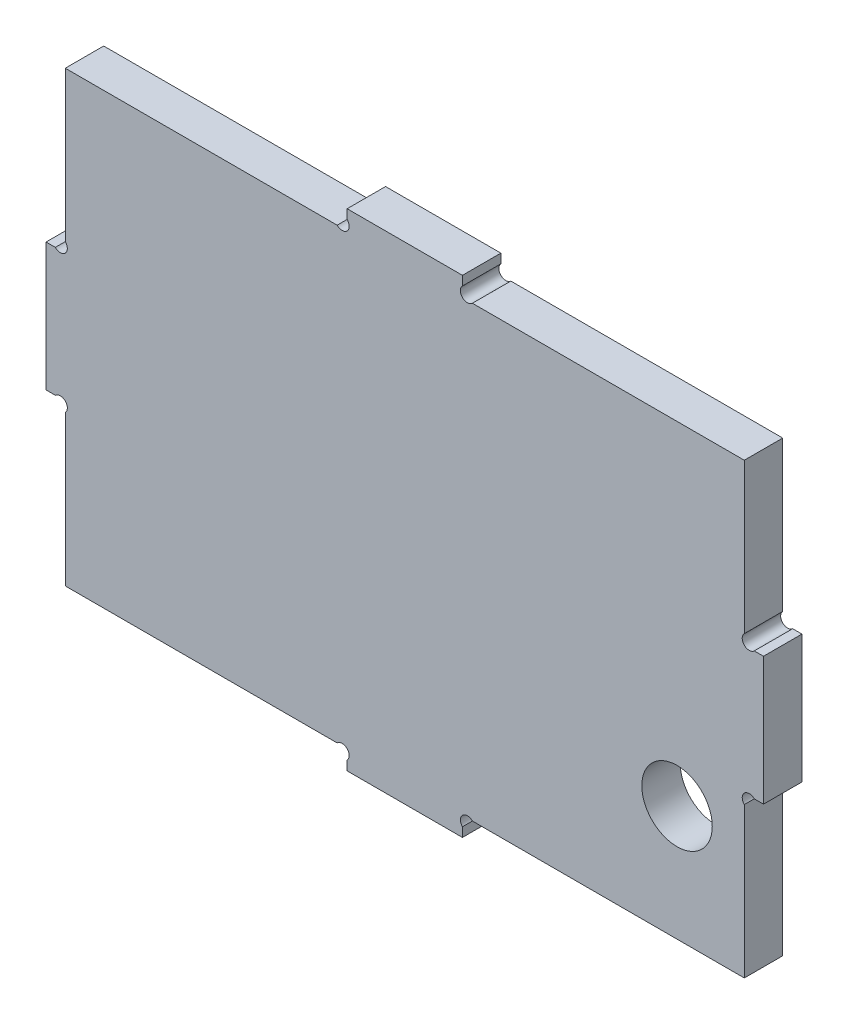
from build123d import *

# Parameters (mm, degrees)
ESQUISSE1_R        = 5.5
BOSS_EXTRU_1_DEPTH = 6


with BuildPart() as part:
    # Esquisse1 → Boss.-Extru.1 (new body)
    with BuildSketch(Plane.XY):
        with BuildLine():
            Line((65, 71.555634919), (65, 73))
            Line((65, 73), (47, 73))
            Line((47, 73), (47, 71.555634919))
            ThreePointArc((47, 71.555634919), (47, 70), (45.444365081, 70))
            Line((45.444365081, 70), (3, 70))
            Line((3, 70), (3, 46.555634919))
            ThreePointArc((3, 46.555634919), (3, 45), (1.444365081, 45))
            Line((1.444365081, 45), (0, 45))
            Line((0, 45), (0, 25))
            Line((0, 25), (1.444365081, 25))
            ThreePointArc((1.444365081, 25), (3, 25), (3, 23.444365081))
            Line((3, 23.444365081), (3, 0))
            Line((3, 0), (45.444365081, 0))
            ThreePointArc((45.444365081, 0), (47, 0), (47, -1.555634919))
            Line((47, -1.555634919), (47, -3))
            Line((47, -3), (65, -3))
            Line((65, -3), (65, -1.555634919))
            ThreePointArc((65, -1.555634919), (65, 0), (66.555634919, 0))
            Line((66.555634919, 0), (109, 0))
            Line((109, 0), (109, 23.444365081))
            ThreePointArc((109, 23.444365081), (109, 25), (110.555634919, 25))
            Line((110.555634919, 25), (112, 25))
            Line((112, 25), (112, 45))
            Line((112, 45), (110.555634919, 45))
            ThreePointArc((110.555634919, 45), (109, 45), (109, 46.555634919))
            Line((109, 46.555634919), (109, 70))
            Line((109, 70), (66.555634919, 70))
            ThreePointArc((66.555634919, 70), (65, 70), (65, 71.555634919))
        make_face()
        with Locations((98.5, 18)):
            Circle(ESQUISSE1_R, mode=Mode.SUBTRACT)
    extrude(amount=BOSS_EXTRU_1_DEPTH)


solid = part.part
